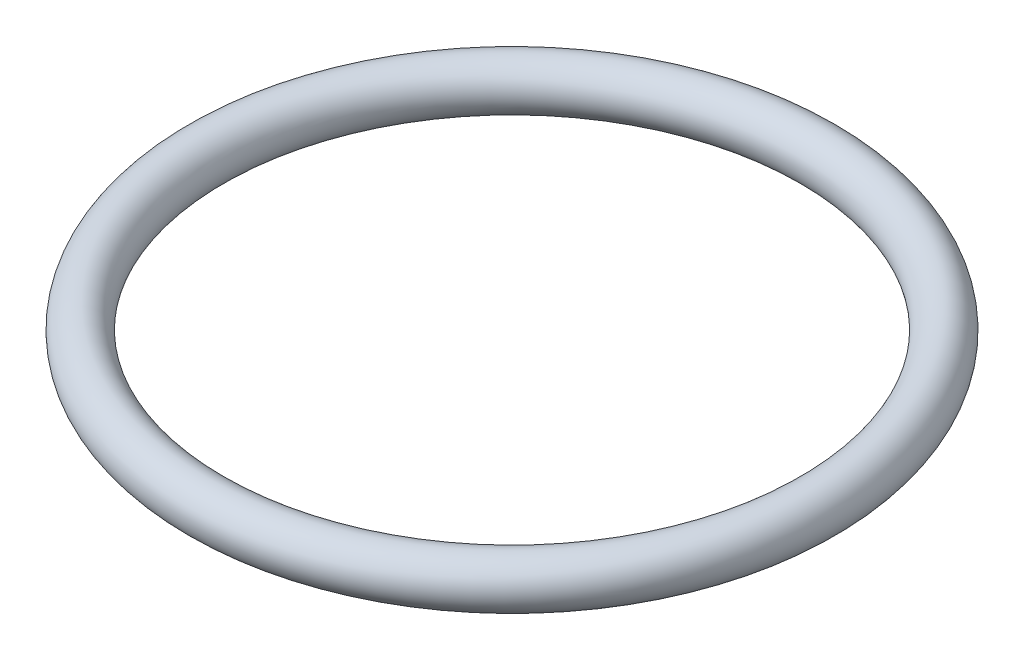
from build123d import *

# Parameters (mm, degrees)
SKETCH1_R = 0.4953


with BuildPart() as part:
    # Sketch1 → Revolve1 (revolve)
    with BuildSketch(Plane.XY, mode=Mode.PRIVATE) as revolve1_sk:
        with Locations((6.2484, -0.4953)):
            Circle(SKETCH1_R)
    revolve(revolve1_sk.sketch.rotate(Axis((0, 0, 0), (0, -1, 0)), 90), axis=Axis((0, 0, 0), (0, -1, 0)))


solid = part.part
